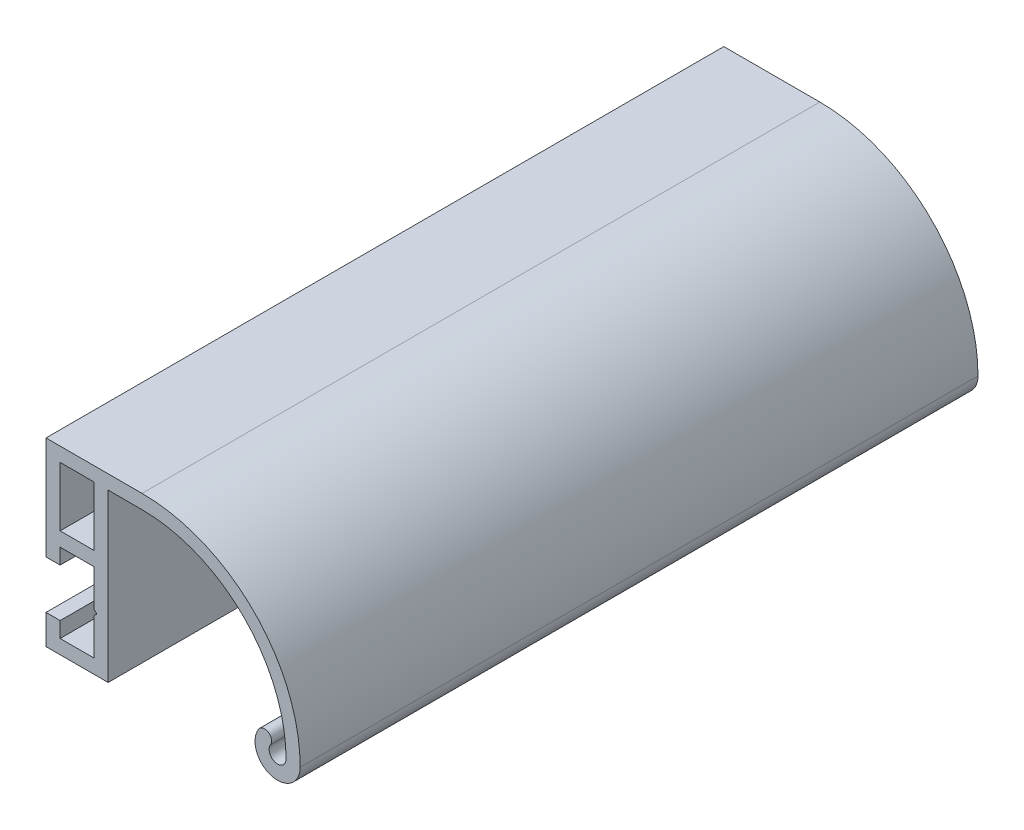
ISO-10303-21;
HEADER;
FILE_DESCRIPTION(('STEP AP214'),'2;1');
FILE_NAME('part.step','',(''),(''),'','','');
FILE_SCHEMA(('AUTOMOTIVE_DESIGN { 1 0 10303 214 1 1 1 1 }'));
ENDSEC;
DATA;
#1=APPLICATION_CONTEXT('core data for automotive mechanical design processes');
#2=APPLICATION_PROTOCOL_DEFINITION('international standard','automotive_design',2000,#1);
#3=PRODUCT_CONTEXT('',#1,'mechanical');
#4=PRODUCT('Part','Part','',(#3));
#5=PRODUCT_RELATED_PRODUCT_CATEGORY('part','',(#4));
#6=PRODUCT_DEFINITION_FORMATION('','',#4);
#7=PRODUCT_DEFINITION_CONTEXT('part definition',#1,'design');
#8=PRODUCT_DEFINITION('design','',#6,#7);
#9=PRODUCT_DEFINITION_SHAPE('','',#8);
#10=(LENGTH_UNIT() NAMED_UNIT(*) SI_UNIT(.MILLI.,.METRE.));
#11=(NAMED_UNIT(*) PLANE_ANGLE_UNIT() SI_UNIT($,.RADIAN.));
#12=(NAMED_UNIT(*) SI_UNIT($,.STERADIAN.) SOLID_ANGLE_UNIT());
#13=UNCERTAINTY_MEASURE_WITH_UNIT(LENGTH_MEASURE(1.E-05),#10,'distance_accuracy_value','');
#14=(GEOMETRIC_REPRESENTATION_CONTEXT(3) GLOBAL_UNCERTAINTY_ASSIGNED_CONTEXT((#13)) GLOBAL_UNIT_ASSIGNED_CONTEXT((#10,
#11,#12)) REPRESENTATION_CONTEXT('',''));
#15=CARTESIAN_POINT('',(0.,0.,0.));
#16=DIRECTION('',(0.,0.,1.));
#17=DIRECTION('',(1.,0.,0.));
#18=AXIS2_PLACEMENT_3D('',#15,#16,#17);
#19=CARTESIAN_POINT('',(-19.9999990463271,-4.2500000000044,-60.));
#20=DIRECTION('',(0.,1.,0.));
#21=DIRECTION('',(-1.,0.,0.));
#22=AXIS2_PLACEMENT_3D('',#19,#20,#21);
#23=PLANE('',#22);
#24=DIRECTION('',(0.,0.,1.));
#25=VECTOR('',#24,1.);
#26=CARTESIAN_POINT('',(-22.4999990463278,-4.25000000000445,-60.));
#27=LINE('',#26,#25);
#28=CARTESIAN_POINT('',(-22.4999990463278,-4.25000000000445,-60.));
#29=VERTEX_POINT('',#28);
#30=CARTESIAN_POINT('',(-22.4999990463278,-4.25000000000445,60.));
#31=VERTEX_POINT('',#30);
#32=EDGE_CURVE('E33',#29,#31,#27,.T.);
#33=ORIENTED_EDGE('',*,*,#32,.T.);
#34=DIRECTION('',(-1.,0.,0.));
#35=VECTOR('',#34,1.);
#36=CARTESIAN_POINT('',(-19.9999990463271,-4.2500000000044,60.));
#37=LINE('',#36,#35);
#38=CARTESIAN_POINT('',(-19.9999990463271,-4.2500000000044,60.));
#39=VERTEX_POINT('',#38);
#40=EDGE_CURVE('E227',#39,#31,#37,.T.);
#41=ORIENTED_EDGE('',*,*,#40,.F.);
#42=DIRECTION('',(0.,0.,1.));
#43=VECTOR('',#42,1.);
#44=CARTESIAN_POINT('',(-19.9999990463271,-4.2500000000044,-60.));
#45=LINE('',#44,#43);
#46=CARTESIAN_POINT('',(-19.9999990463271,-4.2500000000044,-60.));
#47=VERTEX_POINT('',#46);
#48=EDGE_CURVE('E11',#47,#39,#45,.T.);
#49=ORIENTED_EDGE('',*,*,#48,.F.);
#50=DIRECTION('',(-1.,0.,0.));
#51=VECTOR('',#50,1.);
#52=CARTESIAN_POINT('',(-19.9999990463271,-4.2500000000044,-60.));
#53=LINE('',#52,#51);
#54=EDGE_CURVE('E297',#47,#29,#53,.T.);
#55=ORIENTED_EDGE('',*,*,#54,.T.);
#56=EDGE_LOOP('',(#33,#41,#49,#55));
#57=FACE_BOUND('',#56,.T.);
#58=ADVANCED_FACE('F30',(#57),#23,.T.);
#59=CARTESIAN_POINT('',(-19.9999990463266,-7.0000000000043,-60.));
#60=DIRECTION('',(1.,1.58963751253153E-13,0.));
#61=DIRECTION('',(-1.58963751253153E-13,1.,0.));
#62=AXIS2_PLACEMENT_3D('',#59,#60,#61);
#63=PLANE('',#62);
#64=ORIENTED_EDGE('',*,*,#48,.T.);
#65=DIRECTION('',(-1.58963751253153E-13,1.,0.));
#66=VECTOR('',#65,1.);
#67=CARTESIAN_POINT('',(-19.9999990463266,-7.0000000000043,60.));
#68=LINE('',#67,#66);
#69=CARTESIAN_POINT('',(-19.9999990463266,-7.0000000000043,60.));
#70=VERTEX_POINT('',#69);
#71=EDGE_CURVE('E287',#70,#39,#68,.T.);
#72=ORIENTED_EDGE('',*,*,#71,.F.);
#73=DIRECTION('',(0.,0.,1.));
#74=VECTOR('',#73,1.);
#75=CARTESIAN_POINT('',(-19.9999990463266,-7.0000000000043,-60.));
#76=LINE('',#75,#74);
#77=CARTESIAN_POINT('',(-19.9999990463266,-7.0000000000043,-60.));
#78=VERTEX_POINT('',#77);
#79=EDGE_CURVE('E38',#78,#70,#76,.T.);
#80=ORIENTED_EDGE('',*,*,#79,.F.);
#81=DIRECTION('',(-1.58963751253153E-13,1.,0.));
#82=VECTOR('',#81,1.);
#83=CARTESIAN_POINT('',(-19.9999990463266,-7.0000000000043,-60.));
#84=LINE('',#83,#82);
#85=EDGE_CURVE('E359',#78,#47,#84,.T.);
#86=ORIENTED_EDGE('',*,*,#85,.T.);
#87=EDGE_LOOP('',(#64,#72,#80,#86));
#88=FACE_BOUND('',#87,.T.);
#89=ADVANCED_FACE('F406',(#88),#63,.T.);
#90=CARTESIAN_POINT('',(-13.9999990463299,-7.00000000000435,-60.));
#91=DIRECTION('',(0.,1.,0.));
#92=DIRECTION('',(-1.,0.,0.));
#93=AXIS2_PLACEMENT_3D('',#90,#91,#92);
#94=PLANE('',#93);
#95=ORIENTED_EDGE('',*,*,#79,.T.);
#96=DIRECTION('',(-1.,0.,0.));
#97=VECTOR('',#96,1.);
#98=CARTESIAN_POINT('',(-13.9999990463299,-7.00000000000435,60.));
#99=LINE('',#98,#97);
#100=CARTESIAN_POINT('',(-13.9999990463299,-7.00000000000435,60.));
#101=VERTEX_POINT('',#100);
#102=EDGE_CURVE('E284',#101,#70,#99,.T.);
#103=ORIENTED_EDGE('',*,*,#102,.F.);
#104=DIRECTION('',(0.,0.,1.));
#105=VECTOR('',#104,1.);
#106=CARTESIAN_POINT('',(-13.9999990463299,-7.00000000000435,-60.));
#107=LINE('',#106,#105);
#108=CARTESIAN_POINT('',(-13.9999990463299,-7.00000000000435,-60.));
#109=VERTEX_POINT('',#108);
#110=EDGE_CURVE('E363',#109,#101,#107,.T.);
#111=ORIENTED_EDGE('',*,*,#110,.F.);
#112=DIRECTION('',(-1.,0.,0.));
#113=VECTOR('',#112,1.);
#114=CARTESIAN_POINT('',(-13.9999990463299,-7.00000000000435,-60.));
#115=LINE('',#114,#113);
#116=EDGE_CURVE('E356',#109,#78,#115,.T.);
#117=ORIENTED_EDGE('',*,*,#116,.T.);
#118=EDGE_LOOP('',(#95,#103,#111,#117));
#119=FACE_BOUND('',#118,.T.);
#120=ADVANCED_FACE('F479',(#119),#94,.T.);
#121=CARTESIAN_POINT('',(-13.9999990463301,-0.500000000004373,-60.));
#122=DIRECTION('',(-1.,0.,0.));
#123=DIRECTION('',(0.,-1.,0.));
#124=AXIS2_PLACEMENT_3D('',#121,#122,#123);
#125=PLANE('',#124);
#126=ORIENTED_EDGE('',*,*,#110,.T.);
#127=DIRECTION('',(0.,-1.,0.));
#128=VECTOR('',#127,1.);
#129=CARTESIAN_POINT('',(-13.9999990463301,-0.500000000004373,60.));
#130=LINE('',#129,#128);
#131=CARTESIAN_POINT('',(-13.9999990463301,-0.500000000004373,60.));
#132=VERTEX_POINT('',#131);
#133=EDGE_CURVE('E281',#132,#101,#130,.T.);
#134=ORIENTED_EDGE('',*,*,#133,.F.);
#135=DIRECTION('',(0.,0.,1.));
#136=VECTOR('',#135,1.);
#137=CARTESIAN_POINT('',(-13.9999990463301,-0.500000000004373,-60.));
#138=LINE('',#137,#136);
#139=CARTESIAN_POINT('',(-13.9999990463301,-0.500000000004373,-60.));
#140=VERTEX_POINT('',#139);
#141=EDGE_CURVE('E365',#140,#132,#138,.T.);
#142=ORIENTED_EDGE('',*,*,#141,.F.);
#143=DIRECTION('',(0.,-1.,0.));
#144=VECTOR('',#143,1.);
#145=CARTESIAN_POINT('',(-13.9999990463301,-0.500000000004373,-60.));
#146=LINE('',#145,#144);
#147=EDGE_CURVE('E353',#140,#109,#146,.T.);
#148=ORIENTED_EDGE('',*,*,#147,.T.);
#149=EDGE_LOOP('',(#126,#134,#142,#148));
#150=FACE_BOUND('',#149,.T.);
#151=ADVANCED_FACE('F477',(#150),#125,.T.);
#152=CARTESIAN_POINT('',(-13.4999990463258,0.,-60.));
#153=DIRECTION('',(-0.70710678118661,0.707106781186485,0.));
#154=DIRECTION('',(-0.707106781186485,-0.70710678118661,0.));
#155=AXIS2_PLACEMENT_3D('',#152,#153,#154);
#156=PLANE('',#155);
#157=ORIENTED_EDGE('',*,*,#141,.T.);
#158=DIRECTION('',(-0.707106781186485,-0.70710678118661,0.));
#159=VECTOR('',#158,1.);
#160=CARTESIAN_POINT('',(-13.4999990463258,0.,60.));
#161=LINE('',#160,#159);
#162=CARTESIAN_POINT('',(-13.4999990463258,0.,60.));
#163=VERTEX_POINT('',#162);
#164=EDGE_CURVE('E278',#163,#132,#161,.T.);
#165=ORIENTED_EDGE('',*,*,#164,.F.);
#166=DIRECTION('',(0.,0.,1.));
#167=VECTOR('',#166,1.);
#168=CARTESIAN_POINT('',(-13.4999990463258,0.,-60.));
#169=LINE('',#168,#167);
#170=CARTESIAN_POINT('',(-13.4999990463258,0.,-60.));
#171=VERTEX_POINT('',#170);
#172=EDGE_CURVE('E367',#171,#163,#169,.T.);
#173=ORIENTED_EDGE('',*,*,#172,.F.);
#174=DIRECTION('',(-0.707106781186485,-0.70710678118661,0.));
#175=VECTOR('',#174,1.);
#176=CARTESIAN_POINT('',(-13.4999990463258,0.,-60.));
#177=LINE('',#176,#175);
#178=EDGE_CURVE('E350',#171,#140,#177,.T.);
#179=ORIENTED_EDGE('',*,*,#178,.T.);
#180=EDGE_LOOP('',(#157,#165,#173,#179));
#181=FACE_BOUND('',#180,.T.);
#182=ADVANCED_FACE('F473',(#181),#156,.T.);
#183=CARTESIAN_POINT('',(-13.9999990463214,0.499999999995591,-60.));
#184=DIRECTION('',(-0.707106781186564,-0.707106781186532,0.));
#185=DIRECTION('',(0.707106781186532,-0.707106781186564,0.));
#186=AXIS2_PLACEMENT_3D('',#183,#184,#185);
#187=PLANE('',#186);
#188=ORIENTED_EDGE('',*,*,#172,.T.);
#189=DIRECTION('',(0.707106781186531,-0.707106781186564,0.));
#190=VECTOR('',#189,1.);
#191=CARTESIAN_POINT('',(-13.9999990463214,0.499999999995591,60.));
#192=LINE('',#191,#190);
#193=CARTESIAN_POINT('',(-13.9999990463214,0.499999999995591,60.));
#194=VERTEX_POINT('',#193);
#195=EDGE_CURVE('E275',#194,#163,#192,.T.);
#196=ORIENTED_EDGE('',*,*,#195,.F.);
#197=DIRECTION('',(0.,0.,1.));
#198=VECTOR('',#197,1.);
#199=CARTESIAN_POINT('',(-13.9999990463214,0.499999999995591,-60.));
#200=LINE('',#199,#198);
#201=CARTESIAN_POINT('',(-13.9999990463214,0.499999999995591,-60.));
#202=VERTEX_POINT('',#201);
#203=EDGE_CURVE('E369',#202,#194,#200,.T.);
#204=ORIENTED_EDGE('',*,*,#203,.F.);
#205=DIRECTION('',(0.707106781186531,-0.707106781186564,0.));
#206=VECTOR('',#205,1.);
#207=CARTESIAN_POINT('',(-13.9999990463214,0.499999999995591,-60.));
#208=LINE('',#207,#206);
#209=EDGE_CURVE('E347',#202,#171,#208,.T.);
#210=ORIENTED_EDGE('',*,*,#209,.T.);
#211=EDGE_LOOP('',(#188,#196,#204,#210));
#212=FACE_BOUND('',#211,.T.);
#213=ADVANCED_FACE('F470',(#212),#187,.T.);
#214=CARTESIAN_POINT('',(-13.9999990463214,6.99999999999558,-60.));
#215=DIRECTION('',(-1.,0.,0.));
#216=DIRECTION('',(0.,-1.,0.));
#217=AXIS2_PLACEMENT_3D('',#214,#215,#216);
#218=PLANE('',#217);
#219=ORIENTED_EDGE('',*,*,#203,.T.);
#220=DIRECTION('',(0.,-1.,0.));
#221=VECTOR('',#220,1.);
#222=CARTESIAN_POINT('',(-13.9999990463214,6.99999999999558,60.));
#223=LINE('',#222,#221);
#224=CARTESIAN_POINT('',(-13.9999990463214,6.99999999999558,60.));
#225=VERTEX_POINT('',#224);
#226=EDGE_CURVE('E272',#225,#194,#223,.T.);
#227=ORIENTED_EDGE('',*,*,#226,.F.);
#228=DIRECTION('',(0.,0.,1.));
#229=VECTOR('',#228,1.);
#230=CARTESIAN_POINT('',(-13.9999990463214,6.99999999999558,-60.));
#231=LINE('',#230,#229);
#232=CARTESIAN_POINT('',(-13.9999990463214,6.99999999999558,-60.));
#233=VERTEX_POINT('',#232);
#234=EDGE_CURVE('E371',#233,#225,#231,.T.);
#235=ORIENTED_EDGE('',*,*,#234,.F.);
#236=DIRECTION('',(0.,-1.,0.));
#237=VECTOR('',#236,1.);
#238=CARTESIAN_POINT('',(-13.9999990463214,6.99999999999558,-60.));
#239=LINE('',#238,#237);
#240=EDGE_CURVE('E344',#233,#202,#239,.T.);
#241=ORIENTED_EDGE('',*,*,#240,.T.);
#242=EDGE_LOOP('',(#219,#227,#235,#241));
#243=FACE_BOUND('',#242,.T.);
#244=ADVANCED_FACE('F468',(#243),#218,.T.);
#245=CARTESIAN_POINT('',(-19.9999990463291,6.99999999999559,-60.));
#246=DIRECTION('',(0.,-1.,0.));
#247=DIRECTION('',(1.,0.,0.));
#248=AXIS2_PLACEMENT_3D('',#245,#246,#247);
#249=PLANE('',#248);
#250=ORIENTED_EDGE('',*,*,#234,.T.);
#251=DIRECTION('',(1.,0.,0.));
#252=VECTOR('',#251,1.);
#253=CARTESIAN_POINT('',(-19.9999990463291,6.99999999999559,60.));
#254=LINE('',#253,#252);
#255=CARTESIAN_POINT('',(-19.9999990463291,6.99999999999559,60.));
#256=VERTEX_POINT('',#255);
#257=EDGE_CURVE('E269',#256,#225,#254,.T.);
#258=ORIENTED_EDGE('',*,*,#257,.F.);
#259=DIRECTION('',(0.,0.,1.));
#260=VECTOR('',#259,1.);
#261=CARTESIAN_POINT('',(-19.9999990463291,6.99999999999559,-60.));
#262=LINE('',#261,#260);
#263=CARTESIAN_POINT('',(-19.9999990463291,6.99999999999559,-60.));
#264=VERTEX_POINT('',#263);
#265=EDGE_CURVE('E373',#264,#256,#262,.T.);
#266=ORIENTED_EDGE('',*,*,#265,.F.);
#267=DIRECTION('',(1.,0.,0.));
#268=VECTOR('',#267,1.);
#269=CARTESIAN_POINT('',(-19.9999990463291,6.99999999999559,-60.));
#270=LINE('',#269,#268);
#271=EDGE_CURVE('E341',#264,#233,#270,.T.);
#272=ORIENTED_EDGE('',*,*,#271,.T.);
#273=EDGE_LOOP('',(#250,#258,#266,#272));
#274=FACE_BOUND('',#273,.T.);
#275=ADVANCED_FACE('F463',(#274),#249,.T.);
#276=CARTESIAN_POINT('',(-19.9999990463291,4.24999999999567,-60.));
#277=DIRECTION('',(1.,0.,0.));
#278=DIRECTION('',(0.,1.,0.));
#279=AXIS2_PLACEMENT_3D('',#276,#277,#278);
#280=PLANE('',#279);
#281=ORIENTED_EDGE('',*,*,#265,.T.);
#282=DIRECTION('',(0.,1.,0.));
#283=VECTOR('',#282,1.);
#284=CARTESIAN_POINT('',(-19.9999990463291,4.24999999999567,60.));
#285=LINE('',#284,#283);
#286=CARTESIAN_POINT('',(-19.9999990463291,4.24999999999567,60.));
#287=VERTEX_POINT('',#286);
#288=EDGE_CURVE('E266',#287,#256,#285,.T.);
#289=ORIENTED_EDGE('',*,*,#288,.F.);
#290=DIRECTION('',(0.,0.,1.));
#291=VECTOR('',#290,1.);
#292=CARTESIAN_POINT('',(-19.9999990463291,4.24999999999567,-60.));
#293=LINE('',#292,#291);
#294=CARTESIAN_POINT('',(-19.9999990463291,4.24999999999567,-60.));
#295=VERTEX_POINT('',#294);
#296=EDGE_CURVE('E375',#295,#287,#293,.T.);
#297=ORIENTED_EDGE('',*,*,#296,.F.);
#298=DIRECTION('',(0.,1.,0.));
#299=VECTOR('',#298,1.);
#300=CARTESIAN_POINT('',(-19.9999990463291,4.24999999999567,-60.));
#301=LINE('',#300,#299);
#302=EDGE_CURVE('E338',#295,#264,#301,.T.);
#303=ORIENTED_EDGE('',*,*,#302,.T.);
#304=EDGE_LOOP('',(#281,#289,#297,#303));
#305=FACE_BOUND('',#304,.T.);
#306=ADVANCED_FACE('F458',(#305),#280,.T.);
#307=CARTESIAN_POINT('',(-22.4999990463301,4.2499999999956,-60.));
#308=DIRECTION('',(0.,-1.,0.));
#309=DIRECTION('',(1.,0.,0.));
#310=AXIS2_PLACEMENT_3D('',#307,#308,#309);
#311=PLANE('',#310);
#312=ORIENTED_EDGE('',*,*,#296,.T.);
#313=DIRECTION('',(1.,0.,0.));
#314=VECTOR('',#313,1.);
#315=CARTESIAN_POINT('',(-22.4999990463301,4.2499999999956,60.));
#316=LINE('',#315,#314);
#317=CARTESIAN_POINT('',(-22.4999990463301,4.2499999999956,60.));
#318=VERTEX_POINT('',#317);
#319=EDGE_CURVE('E263',#318,#287,#316,.T.);
#320=ORIENTED_EDGE('',*,*,#319,.F.);
#321=DIRECTION('',(0.,0.,1.));
#322=VECTOR('',#321,1.);
#323=CARTESIAN_POINT('',(-22.4999990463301,4.2499999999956,-60.));
#324=LINE('',#323,#322);
#325=CARTESIAN_POINT('',(-22.4999990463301,4.2499999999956,-60.));
#326=VERTEX_POINT('',#325);
#327=EDGE_CURVE('E377',#326,#318,#324,.T.);
#328=ORIENTED_EDGE('',*,*,#327,.F.);
#329=DIRECTION('',(1.,0.,0.));
#330=VECTOR('',#329,1.);
#331=CARTESIAN_POINT('',(-22.4999990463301,4.2499999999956,-60.));
#332=LINE('',#331,#330);
#333=EDGE_CURVE('E335',#326,#295,#332,.T.);
#334=ORIENTED_EDGE('',*,*,#333,.T.);
#335=EDGE_LOOP('',(#312,#320,#328,#334));
#336=FACE_BOUND('',#335,.T.);
#337=ADVANCED_FACE('F456',(#336),#311,.T.);
#338=CARTESIAN_POINT('',(-22.4999990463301,22.499998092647,-60.));
#339=DIRECTION('',(-1.,0.,0.));
#340=DIRECTION('',(0.,0.,1.));
#341=AXIS2_PLACEMENT_3D('',#338,#339,#340);
#342=PLANE('',#341);
#343=ORIENTED_EDGE('',*,*,#327,.T.);
#344=DIRECTION('',(0.,-1.,0.));
#345=VECTOR('',#344,1.);
#346=CARTESIAN_POINT('',(-22.4999990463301,22.499998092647,60.));
#347=LINE('',#346,#345);
#348=CARTESIAN_POINT('',(-22.4999990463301,22.499998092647,60.));
#349=VERTEX_POINT('',#348);
#350=EDGE_CURVE('E260',#349,#318,#347,.T.);
#351=ORIENTED_EDGE('',*,*,#350,.F.);
#352=DIRECTION('',(0.,0.,1.));
#353=VECTOR('',#352,1.);
#354=CARTESIAN_POINT('',(-22.4999990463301,22.499998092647,-60.));
#355=LINE('',#354,#353);
#356=CARTESIAN_POINT('',(-22.4999990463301,22.499998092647,-60.));
#357=VERTEX_POINT('',#356);
#358=EDGE_CURVE('E379',#357,#349,#355,.T.);
#359=ORIENTED_EDGE('',*,*,#358,.F.);
#360=DIRECTION('',(0.,-1.,0.));
#361=VECTOR('',#360,1.);
#362=CARTESIAN_POINT('',(-22.4999990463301,22.499998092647,-60.));
#363=LINE('',#362,#361);
#364=EDGE_CURVE('E332',#357,#326,#363,.T.);
#365=ORIENTED_EDGE('',*,*,#364,.T.);
#366=EDGE_LOOP('',(#343,#351,#359,#365));
#367=FACE_BOUND('',#366,.T.);
#368=ADVANCED_FACE('F451',(#367),#342,.T.);
#369=CARTESIAN_POINT('',(-5.4999990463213,22.499998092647,-60.));
#370=DIRECTION('',(0.,1.,0.));
#371=DIRECTION('',(-1.,0.,0.));
#372=AXIS2_PLACEMENT_3D('',#369,#370,#371);
#373=PLANE('',#372);
#374=ORIENTED_EDGE('',*,*,#358,.T.);
#375=DIRECTION('',(-1.,0.,0.));
#376=VECTOR('',#375,1.);
#377=CARTESIAN_POINT('',(-5.4999990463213,22.499998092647,60.));
#378=LINE('',#377,#376);
#379=CARTESIAN_POINT('',(-5.4999990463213,22.499998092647,60.));
#380=VERTEX_POINT('',#379);
#381=EDGE_CURVE('E257',#380,#349,#378,.T.);
#382=ORIENTED_EDGE('',*,*,#381,.F.);
#383=DIRECTION('',(0.,0.,1.));
#384=VECTOR('',#383,1.);
#385=CARTESIAN_POINT('',(-5.4999990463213,22.499998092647,-60.));
#386=LINE('',#385,#384);
#387=CARTESIAN_POINT('',(-5.4999990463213,22.499998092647,-60.));
#388=VERTEX_POINT('',#387);
#389=EDGE_CURVE('E381',#388,#380,#386,.T.);
#390=ORIENTED_EDGE('',*,*,#389,.F.);
#391=DIRECTION('',(-1.,0.,0.));
#392=VECTOR('',#391,1.);
#393=CARTESIAN_POINT('',(-5.4999990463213,22.499998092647,-60.));
#394=LINE('',#393,#392);
#395=EDGE_CURVE('E329',#388,#357,#394,.T.);
#396=ORIENTED_EDGE('',*,*,#395,.T.);
#397=EDGE_LOOP('',(#374,#382,#390,#396));
#398=FACE_BOUND('',#397,.T.);
#399=ADVANCED_FACE('F446',(#398),#373,.T.);
#400=CARTESIAN_POINT('',(-5.49999904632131,-5.50000000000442,-60.));
#401=DIRECTION('',(0.,0.,1.));
#402=DIRECTION('',(1.,0.,0.));
#403=AXIS2_PLACEMENT_3D('',#400,#401,#402);
#404=CYLINDRICAL_SURFACE('',#403,27.9999980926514);
#405=ORIENTED_EDGE('',*,*,#389,.T.);
#406=CARTESIAN_POINT('',(-5.49999904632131,-5.50000000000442,60.));
#407=DIRECTION('',(0.,0.,1.));
#408=DIRECTION('',(1.,0.,0.));
#409=AXIS2_PLACEMENT_3D('',#406,#407,#408);
#410=CIRCLE('',#409,27.9999980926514);
#411=CARTESIAN_POINT('',(22.4999990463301,-5.50000000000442,60.));
#412=VERTEX_POINT('',#411);
#413=EDGE_CURVE('E254',#412,#380,#410,.T.);
#414=ORIENTED_EDGE('',*,*,#413,.F.);
#415=DIRECTION('',(0.,0.,1.));
#416=VECTOR('',#415,1.);
#417=CARTESIAN_POINT('',(22.4999990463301,-5.50000000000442,-60.));
#418=LINE('',#417,#416);
#419=CARTESIAN_POINT('',(22.4999990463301,-5.50000000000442,-60.));
#420=VERTEX_POINT('',#419);
#421=EDGE_CURVE('E383',#420,#412,#418,.T.);
#422=ORIENTED_EDGE('',*,*,#421,.F.);
#423=CARTESIAN_POINT('',(-5.49999904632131,-5.50000000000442,-60.));
#424=DIRECTION('',(0.,0.,1.));
#425=DIRECTION('',(1.,0.,0.));
#426=AXIS2_PLACEMENT_3D('',#423,#424,#425);
#427=CIRCLE('',#426,27.9999980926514);
#428=EDGE_CURVE('E326',#420,#388,#427,.T.);
#429=ORIENTED_EDGE('',*,*,#428,.T.);
#430=EDGE_LOOP('',(#405,#414,#422,#429));
#431=FACE_BOUND('',#430,.T.);
#432=ADVANCED_FACE('F444',(#431),#404,.T.);
#433=CARTESIAN_POINT('',(18.4999983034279,-5.50000000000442,-60.));
#434=DIRECTION('',(0.,0.,1.));
#435=DIRECTION('',(1.,0.,0.));
#436=AXIS2_PLACEMENT_3D('',#433,#434,#435);
#437=CYLINDRICAL_SURFACE('',#436,4.00000074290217);
#438=ORIENTED_EDGE('',*,*,#421,.T.);
#439=CARTESIAN_POINT('',(18.4999983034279,-5.50000000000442,60.));
#440=DIRECTION('',(0.,0.,1.));
#441=DIRECTION('',(1.,0.,0.));
#442=AXIS2_PLACEMENT_3D('',#439,#440,#441);
#443=CIRCLE('',#442,4.00000074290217);
#444=CARTESIAN_POINT('',(15.1439566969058,-3.32353711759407,60.));
#445=VERTEX_POINT('',#444);
#446=EDGE_CURVE('E251',#445,#412,#443,.T.);
#447=ORIENTED_EDGE('',*,*,#446,.F.);
#448=DIRECTION('',(0.,0.,1.));
#449=VECTOR('',#448,1.);
#450=CARTESIAN_POINT('',(15.1439566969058,-3.32353711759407,-60.));
#451=LINE('',#450,#449);
#452=CARTESIAN_POINT('',(15.1439566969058,-3.32353711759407,-60.));
#453=VERTEX_POINT('',#452);
#454=EDGE_CURVE('E385',#453,#445,#451,.T.);
#455=ORIENTED_EDGE('',*,*,#454,.F.);
#456=CARTESIAN_POINT('',(18.4999983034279,-5.50000000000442,-60.));
#457=DIRECTION('',(0.,0.,1.));
#458=DIRECTION('',(1.,0.,0.));
#459=AXIS2_PLACEMENT_3D('',#456,#457,#458);
#460=CIRCLE('',#459,4.00000074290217);
#461=EDGE_CURVE('E323',#453,#420,#460,.T.);
#462=ORIENTED_EDGE('',*,*,#461,.T.);
#463=EDGE_LOOP('',(#438,#447,#455,#462));
#464=FACE_BOUND('',#463,.T.);
#465=ADVANCED_FACE('F439',(#464),#437,.T.);
#466=CARTESIAN_POINT('',(16.1927195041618,-4.00368164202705,-60.));
#467=DIRECTION('',(0.,0.,1.));
#468=DIRECTION('',(1.,0.,0.));
#469=AXIS2_PLACEMENT_3D('',#466,#467,#468);
#470=CYLINDRICAL_SURFACE('',#469,1.24999999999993);
#471=ORIENTED_EDGE('',*,*,#454,.T.);
#472=CARTESIAN_POINT('',(16.1927195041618,-4.00368164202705,60.));
#473=DIRECTION('',(0.,0.,1.));
#474=DIRECTION('',(1.,0.,0.));
#475=AXIS2_PLACEMENT_3D('',#472,#473,#474);
#476=CIRCLE('',#475,1.24999999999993);
#477=CARTESIAN_POINT('',(17.2414823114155,-4.68382616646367,60.));
#478=VERTEX_POINT('',#477);
#479=EDGE_CURVE('E248',#478,#445,#476,.T.);
#480=ORIENTED_EDGE('',*,*,#479,.F.);
#481=DIRECTION('',(0.,0.,1.));
#482=VECTOR('',#481,1.);
#483=CARTESIAN_POINT('',(17.2414823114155,-4.68382616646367,-60.));
#484=LINE('',#483,#482);
#485=CARTESIAN_POINT('',(17.2414823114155,-4.68382616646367,-60.));
#486=VERTEX_POINT('',#485);
#487=EDGE_CURVE('E387',#486,#478,#484,.T.);
#488=ORIENTED_EDGE('',*,*,#487,.F.);
#489=CARTESIAN_POINT('',(16.1927195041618,-4.00368164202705,-60.));
#490=DIRECTION('',(0.,0.,1.));
#491=DIRECTION('',(1.,0.,0.));
#492=AXIS2_PLACEMENT_3D('',#489,#490,#491);
#493=CIRCLE('',#492,1.24999999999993);
#494=EDGE_CURVE('E320',#486,#453,#493,.T.);
#495=ORIENTED_EDGE('',*,*,#494,.T.);
#496=EDGE_LOOP('',(#471,#480,#488,#495));
#497=FACE_BOUND('',#496,.T.);
#498=ADVANCED_FACE('F434',(#497),#470,.T.);
#499=CARTESIAN_POINT('',(18.4999983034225,-5.50000000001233,-60.));
#500=DIRECTION('',(0.,0.,1.));
#501=DIRECTION('',(1.,0.,0.));
#502=AXIS2_PLACEMENT_3D('',#499,#500,#501);
#503=CYLINDRICAL_SURFACE('',#502,1.50000074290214);
#504=ORIENTED_EDGE('',*,*,#487,.T.);
#505=CARTESIAN_POINT('',(18.4999983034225,-5.50000000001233,60.));
#506=DIRECTION('',(0.,0.,-1.));
#507=DIRECTION('',(1.,0.,0.));
#508=AXIS2_PLACEMENT_3D('',#505,#506,#507);
#509=CIRCLE('',#508,1.50000074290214);
#510=CARTESIAN_POINT('',(19.9999990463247,-5.49999998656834,60.));
#511=VERTEX_POINT('',#510);
#512=EDGE_CURVE('E245',#511,#478,#509,.T.);
#513=ORIENTED_EDGE('',*,*,#512,.F.);
#514=DIRECTION('',(0.,0.,1.));
#515=VECTOR('',#514,1.);
#516=CARTESIAN_POINT('',(19.9999990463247,-5.49999998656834,-60.));
#517=LINE('',#516,#515);
#518=CARTESIAN_POINT('',(19.9999990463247,-5.49999998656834,-60.));
#519=VERTEX_POINT('',#518);
#520=EDGE_CURVE('E389',#519,#511,#517,.T.);
#521=ORIENTED_EDGE('',*,*,#520,.F.);
#522=CARTESIAN_POINT('',(18.4999983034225,-5.50000000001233,-60.));
#523=DIRECTION('',(0.,0.,-1.));
#524=DIRECTION('',(1.,0.,0.));
#525=AXIS2_PLACEMENT_3D('',#522,#523,#524);
#526=CIRCLE('',#525,1.50000074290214);
#527=EDGE_CURVE('E317',#519,#486,#526,.T.);
#528=ORIENTED_EDGE('',*,*,#527,.T.);
#529=EDGE_LOOP('',(#504,#513,#521,#528));
#530=FACE_BOUND('',#529,.T.);
#531=ADVANCED_FACE('F432',(#530),#503,.F.);
#532=CARTESIAN_POINT('',(-5.49999904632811,-5.50000043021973,-60.));
#533=DIRECTION('',(0.,0.,1.));
#534=DIRECTION('',(1.,0.,0.));
#535=AXIS2_PLACEMENT_3D('',#532,#533,#534);
#536=CYLINDRICAL_SURFACE('',#535,25.4999980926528);
#537=ORIENTED_EDGE('',*,*,#520,.T.);
#538=CARTESIAN_POINT('',(-5.49999904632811,-5.50000043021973,60.));
#539=DIRECTION('',(0.,0.,-1.));
#540=DIRECTION('',(1.,0.,0.));
#541=AXIS2_PLACEMENT_3D('',#538,#539,#540);
#542=CIRCLE('',#541,25.4999980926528);
#543=CARTESIAN_POINT('',(-5.49999904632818,19.9999976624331,60.));
#544=VERTEX_POINT('',#543);
#545=EDGE_CURVE('E242',#544,#511,#542,.T.);
#546=ORIENTED_EDGE('',*,*,#545,.F.);
#547=DIRECTION('',(0.,0.,1.));
#548=VECTOR('',#547,1.);
#549=CARTESIAN_POINT('',(-5.49999904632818,19.9999976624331,-60.));
#550=LINE('',#549,#548);
#551=CARTESIAN_POINT('',(-5.49999904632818,19.9999976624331,-60.));
#552=VERTEX_POINT('',#551);
#553=EDGE_CURVE('E391',#552,#544,#550,.T.);
#554=ORIENTED_EDGE('',*,*,#553,.F.);
#555=CARTESIAN_POINT('',(-5.49999904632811,-5.50000043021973,-60.));
#556=DIRECTION('',(0.,0.,-1.));
#557=DIRECTION('',(1.,0.,0.));
#558=AXIS2_PLACEMENT_3D('',#555,#556,#557);
#559=CIRCLE('',#558,25.4999980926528);
#560=EDGE_CURVE('E314',#552,#519,#559,.T.);
#561=ORIENTED_EDGE('',*,*,#560,.T.);
#562=EDGE_LOOP('',(#537,#546,#554,#561));
#563=FACE_BOUND('',#562,.T.);
#564=ADVANCED_FACE('F427',(#563),#536,.F.);
#565=CARTESIAN_POINT('',(-11.4999990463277,19.9999976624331,-60.));
#566=DIRECTION('',(0.,-1.,0.));
#567=DIRECTION('',(0.,0.,-1.));
#568=AXIS2_PLACEMENT_3D('',#565,#566,#567);
#569=PLANE('',#568);
#570=ORIENTED_EDGE('',*,*,#553,.T.);
#571=DIRECTION('',(1.,0.,0.));
#572=VECTOR('',#571,1.);
#573=CARTESIAN_POINT('',(-11.4999990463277,19.9999976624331,60.));
#574=LINE('',#573,#572);
#575=CARTESIAN_POINT('',(-11.4999990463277,19.9999976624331,60.));
#576=VERTEX_POINT('',#575);
#577=EDGE_CURVE('E239',#576,#544,#574,.T.);
#578=ORIENTED_EDGE('',*,*,#577,.F.);
#579=DIRECTION('',(0.,0.,1.));
#580=VECTOR('',#579,1.);
#581=CARTESIAN_POINT('',(-11.4999990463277,19.9999976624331,-60.));
#582=LINE('',#581,#580);
#583=CARTESIAN_POINT('',(-11.4999990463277,19.9999976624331,-60.));
#584=VERTEX_POINT('',#583);
#585=EDGE_CURVE('E393',#584,#576,#582,.T.);
#586=ORIENTED_EDGE('',*,*,#585,.F.);
#587=DIRECTION('',(1.,0.,0.));
#588=VECTOR('',#587,1.);
#589=CARTESIAN_POINT('',(-11.4999990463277,19.9999976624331,-60.));
#590=LINE('',#589,#588);
#591=EDGE_CURVE('E311',#584,#552,#590,.T.);
#592=ORIENTED_EDGE('',*,*,#591,.T.);
#593=EDGE_LOOP('',(#570,#578,#586,#592));
#594=FACE_BOUND('',#593,.T.);
#595=ADVANCED_FACE('F422',(#594),#569,.T.);
#596=CARTESIAN_POINT('',(-11.4999990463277,-9.50000000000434,-60.));
#597=DIRECTION('',(1.,0.,0.));
#598=DIRECTION('',(0.,0.,-1.));
#599=AXIS2_PLACEMENT_3D('',#596,#597,#598);
#600=PLANE('',#599);
#601=ORIENTED_EDGE('',*,*,#585,.T.);
#602=DIRECTION('',(0.,1.,0.));
#603=VECTOR('',#602,1.);
#604=CARTESIAN_POINT('',(-11.4999990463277,-9.50000000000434,60.));
#605=LINE('',#604,#603);
#606=CARTESIAN_POINT('',(-11.4999990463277,-9.50000000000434,60.));
#607=VERTEX_POINT('',#606);
#608=EDGE_CURVE('E236',#607,#576,#605,.T.);
#609=ORIENTED_EDGE('',*,*,#608,.F.);
#610=DIRECTION('',(0.,0.,1.));
#611=VECTOR('',#610,1.);
#612=CARTESIAN_POINT('',(-11.4999990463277,-9.50000000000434,-60.));
#613=LINE('',#612,#611);
#614=CARTESIAN_POINT('',(-11.4999990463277,-9.50000000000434,-60.));
#615=VERTEX_POINT('',#614);
#616=EDGE_CURVE('E395',#615,#607,#613,.T.);
#617=ORIENTED_EDGE('',*,*,#616,.F.);
#618=DIRECTION('',(0.,1.,0.));
#619=VECTOR('',#618,1.);
#620=CARTESIAN_POINT('',(-11.4999990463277,-9.50000000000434,-60.));
#621=LINE('',#620,#619);
#622=EDGE_CURVE('E308',#615,#584,#621,.T.);
#623=ORIENTED_EDGE('',*,*,#622,.T.);
#624=EDGE_LOOP('',(#601,#609,#617,#623));
#625=FACE_BOUND('',#624,.T.);
#626=ADVANCED_FACE('F420',(#625),#600,.T.);
#627=CARTESIAN_POINT('',(-22.4999990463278,-9.50000000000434,-60.));
#628=DIRECTION('',(0.,-1.,0.));
#629=DIRECTION('',(0.,0.,-1.));
#630=AXIS2_PLACEMENT_3D('',#627,#628,#629);
#631=PLANE('',#630);
#632=ORIENTED_EDGE('',*,*,#616,.T.);
#633=DIRECTION('',(1.,0.,0.));
#634=VECTOR('',#633,1.);
#635=CARTESIAN_POINT('',(-22.4999990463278,-9.50000000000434,60.));
#636=LINE('',#635,#634);
#637=CARTESIAN_POINT('',(-22.4999990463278,-9.50000000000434,60.));
#638=VERTEX_POINT('',#637);
#639=EDGE_CURVE('E233',#638,#607,#636,.T.);
#640=ORIENTED_EDGE('',*,*,#639,.F.);
#641=DIRECTION('',(0.,0.,1.));
#642=VECTOR('',#641,1.);
#643=CARTESIAN_POINT('',(-22.4999990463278,-9.50000000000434,-60.));
#644=LINE('',#643,#642);
#645=CARTESIAN_POINT('',(-22.4999990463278,-9.50000000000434,-60.));
#646=VERTEX_POINT('',#645);
#647=EDGE_CURVE('E396',#646,#638,#644,.T.);
#648=ORIENTED_EDGE('',*,*,#647,.F.);
#649=DIRECTION('',(1.,0.,0.));
#650=VECTOR('',#649,1.);
#651=CARTESIAN_POINT('',(-22.4999990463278,-9.50000000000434,-60.));
#652=LINE('',#651,#650);
#653=EDGE_CURVE('E305',#646,#615,#652,.T.);
#654=ORIENTED_EDGE('',*,*,#653,.T.);
#655=EDGE_LOOP('',(#632,#640,#648,#654));
#656=FACE_BOUND('',#655,.T.);
#657=ADVANCED_FACE('F416',(#656),#631,.T.);
#658=CARTESIAN_POINT('',(-22.4999990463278,-4.25000000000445,-60.));
#659=DIRECTION('',(-1.,0.,0.));
#660=DIRECTION('',(0.,-1.,0.));
#661=AXIS2_PLACEMENT_3D('',#658,#659,#660);
#662=PLANE('',#661);
#663=ORIENTED_EDGE('',*,*,#647,.T.);
#664=DIRECTION('',(0.,-1.,0.));
#665=VECTOR('',#664,1.);
#666=CARTESIAN_POINT('',(-22.4999990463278,-4.25000000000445,60.));
#667=LINE('',#666,#665);
#668=EDGE_CURVE('E230',#31,#638,#667,.T.);
#669=ORIENTED_EDGE('',*,*,#668,.F.);
#670=ORIENTED_EDGE('',*,*,#32,.F.);
#671=DIRECTION('',(0.,-1.,0.));
#672=VECTOR('',#671,1.);
#673=CARTESIAN_POINT('',(-22.4999990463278,-4.25000000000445,-60.));
#674=LINE('',#673,#672);
#675=EDGE_CURVE('E302',#29,#646,#674,.T.);
#676=ORIENTED_EDGE('',*,*,#675,.T.);
#677=EDGE_LOOP('',(#663,#669,#670,#676));
#678=FACE_BOUND('',#677,.T.);
#679=ADVANCED_FACE('F400',(#678),#662,.T.);
#680=CARTESIAN_POINT('',(-5.49999904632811,-5.50000043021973,-60.));
#681=DIRECTION('',(0.,0.,1.));
#682=DIRECTION('',(1.,0.,0.));
#683=AXIS2_PLACEMENT_3D('',#680,#681,#682);
#684=PLANE('',#683);
#685=DIRECTION('',(1.,0.,0.));
#686=VECTOR('',#685,1.);
#687=CARTESIAN_POINT('',(-13.9999990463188,9.49999999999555,-60.));
#688=LINE('',#687,#686);
#689=CARTESIAN_POINT('',(-19.9999990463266,9.49999999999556,-60.));
#690=VERTEX_POINT('',#689);
#691=CARTESIAN_POINT('',(-13.9999990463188,9.49999999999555,-60.));
#692=VERTEX_POINT('',#691);
#693=EDGE_CURVE('E209',#690,#692,#688,.T.);
#694=ORIENTED_EDGE('',*,*,#693,.T.);
#695=DIRECTION('',(0.,1.,0.));
#696=VECTOR('',#695,1.);
#697=CARTESIAN_POINT('',(-13.9999990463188,19.999998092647,-60.));
#698=LINE('',#697,#696);
#699=CARTESIAN_POINT('',(-13.9999990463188,19.999998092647,-60.));
#700=VERTEX_POINT('',#699);
#701=EDGE_CURVE('E290',#692,#700,#698,.T.);
#702=ORIENTED_EDGE('',*,*,#701,.T.);
#703=DIRECTION('',(-1.,0.,0.));
#704=VECTOR('',#703,1.);
#705=CARTESIAN_POINT('',(-19.9999990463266,19.999998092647,-60.));
#706=LINE('',#705,#704);
#707=CARTESIAN_POINT('',(-19.9999990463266,19.999998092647,-60.));
#708=VERTEX_POINT('',#707);
#709=EDGE_CURVE('E204',#700,#708,#706,.T.);
#710=ORIENTED_EDGE('',*,*,#709,.T.);
#711=DIRECTION('',(0.,-1.,0.));
#712=VECTOR('',#711,1.);
#713=CARTESIAN_POINT('',(-19.9999990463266,9.49999999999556,-60.));
#714=LINE('',#713,#712);
#715=EDGE_CURVE('E46',#708,#690,#714,.T.);
#716=ORIENTED_EDGE('',*,*,#715,.T.);
#717=EDGE_LOOP('',(#694,#702,#710,#716));
#718=FACE_BOUND('',#717,.T.);
#719=ORIENTED_EDGE('',*,*,#54,.F.);
#720=ORIENTED_EDGE('',*,*,#85,.F.);
#721=ORIENTED_EDGE('',*,*,#116,.F.);
#722=ORIENTED_EDGE('',*,*,#147,.F.);
#723=ORIENTED_EDGE('',*,*,#178,.F.);
#724=ORIENTED_EDGE('',*,*,#209,.F.);
#725=ORIENTED_EDGE('',*,*,#240,.F.);
#726=ORIENTED_EDGE('',*,*,#271,.F.);
#727=ORIENTED_EDGE('',*,*,#302,.F.);
#728=ORIENTED_EDGE('',*,*,#333,.F.);
#729=ORIENTED_EDGE('',*,*,#364,.F.);
#730=ORIENTED_EDGE('',*,*,#395,.F.);
#731=ORIENTED_EDGE('',*,*,#428,.F.);
#732=ORIENTED_EDGE('',*,*,#461,.F.);
#733=ORIENTED_EDGE('',*,*,#494,.F.);
#734=ORIENTED_EDGE('',*,*,#527,.F.);
#735=ORIENTED_EDGE('',*,*,#560,.F.);
#736=ORIENTED_EDGE('',*,*,#591,.F.);
#737=ORIENTED_EDGE('',*,*,#622,.F.);
#738=ORIENTED_EDGE('',*,*,#653,.F.);
#739=ORIENTED_EDGE('',*,*,#675,.F.);
#740=EDGE_LOOP('',(#719,#720,#721,#722,#723,#724,#725,#726,#727,#728,#729,#730,#731,#732,#733,
#734,#735,#736,#737,#738,#739));
#741=FACE_BOUND('',#740,.T.);
#742=ADVANCED_FACE('F410',(#718,#741),#684,.F.);
#743=CARTESIAN_POINT('',(-13.9999990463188,19.999998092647,-60.));
#744=DIRECTION('',(1.,0.,0.));
#745=DIRECTION('',(0.,0.,-1.));
#746=AXIS2_PLACEMENT_3D('',#743,#744,#745);
#747=PLANE('',#746);
#748=DIRECTION('',(0.,0.,1.));
#749=VECTOR('',#748,1.);
#750=CARTESIAN_POINT('',(-13.9999990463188,9.49999999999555,-60.));
#751=LINE('',#750,#749);
#752=CARTESIAN_POINT('',(-13.9999990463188,9.49999999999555,60.));
#753=VERTEX_POINT('',#752);
#754=EDGE_CURVE('E214',#692,#753,#751,.T.);
#755=ORIENTED_EDGE('',*,*,#754,.T.);
#756=DIRECTION('',(0.,1.,0.));
#757=VECTOR('',#756,1.);
#758=CARTESIAN_POINT('',(-13.9999990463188,19.999998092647,60.));
#759=LINE('',#758,#757);
#760=CARTESIAN_POINT('',(-13.9999990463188,19.999998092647,60.));
#761=VERTEX_POINT('',#760);
#762=EDGE_CURVE('E212',#753,#761,#759,.T.);
#763=ORIENTED_EDGE('',*,*,#762,.T.);
#764=DIRECTION('',(0.,0.,1.));
#765=VECTOR('',#764,1.);
#766=CARTESIAN_POINT('',(-13.9999990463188,19.999998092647,-60.));
#767=LINE('',#766,#765);
#768=EDGE_CURVE('E197',#700,#761,#767,.T.);
#769=ORIENTED_EDGE('',*,*,#768,.F.);
#770=ORIENTED_EDGE('',*,*,#701,.F.);
#771=EDGE_LOOP('',(#755,#763,#769,#770));
#772=FACE_BOUND('',#771,.T.);
#773=ADVANCED_FACE('F213',(#772),#747,.F.);
#774=CARTESIAN_POINT('',(-13.9999990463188,9.49999999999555,-60.));
#775=DIRECTION('',(0.,-1.,0.));
#776=DIRECTION('',(1.,0.,0.));
#777=AXIS2_PLACEMENT_3D('',#774,#775,#776);
#778=PLANE('',#777);
#779=DIRECTION('',(0.,0.,1.));
#780=VECTOR('',#779,1.);
#781=CARTESIAN_POINT('',(-19.9999990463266,9.49999999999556,-60.));
#782=LINE('',#781,#780);
#783=CARTESIAN_POINT('',(-19.9999990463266,9.49999999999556,60.));
#784=VERTEX_POINT('',#783);
#785=EDGE_CURVE('E298',#690,#784,#782,.T.);
#786=ORIENTED_EDGE('',*,*,#785,.T.);
#787=DIRECTION('',(1.,0.,0.));
#788=VECTOR('',#787,1.);
#789=CARTESIAN_POINT('',(-13.9999990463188,9.49999999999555,60.));
#790=LINE('',#789,#788);
#791=EDGE_CURVE('E223',#784,#753,#790,.T.);
#792=ORIENTED_EDGE('',*,*,#791,.T.);
#793=ORIENTED_EDGE('',*,*,#754,.F.);
#794=ORIENTED_EDGE('',*,*,#693,.F.);
#795=EDGE_LOOP('',(#786,#792,#793,#794));
#796=FACE_BOUND('',#795,.T.);
#797=ADVANCED_FACE('F658',(#796),#778,.F.);
#798=CARTESIAN_POINT('',(-19.9999990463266,9.49999999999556,-60.));
#799=DIRECTION('',(-1.,0.,0.));
#800=DIRECTION('',(0.,-1.,0.));
#801=AXIS2_PLACEMENT_3D('',#798,#799,#800);
#802=PLANE('',#801);
#803=DIRECTION('',(0.,0.,1.));
#804=VECTOR('',#803,1.);
#805=CARTESIAN_POINT('',(-19.9999990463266,19.999998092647,-60.));
#806=LINE('',#805,#804);
#807=CARTESIAN_POINT('',(-19.9999990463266,19.999998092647,60.));
#808=VERTEX_POINT('',#807);
#809=EDGE_CURVE('E208',#708,#808,#806,.T.);
#810=ORIENTED_EDGE('',*,*,#809,.T.);
#811=DIRECTION('',(0.,-1.,0.));
#812=VECTOR('',#811,1.);
#813=CARTESIAN_POINT('',(-19.9999990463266,9.49999999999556,60.));
#814=LINE('',#813,#812);
#815=EDGE_CURVE('E221',#808,#784,#814,.T.);
#816=ORIENTED_EDGE('',*,*,#815,.T.);
#817=ORIENTED_EDGE('',*,*,#785,.F.);
#818=ORIENTED_EDGE('',*,*,#715,.F.);
#819=EDGE_LOOP('',(#810,#816,#817,#818));
#820=FACE_BOUND('',#819,.T.);
#821=ADVANCED_FACE('F667',(#820),#802,.F.);
#822=CARTESIAN_POINT('',(-19.9999990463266,19.999998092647,-60.));
#823=DIRECTION('',(0.,1.,0.));
#824=DIRECTION('',(0.,0.,1.));
#825=AXIS2_PLACEMENT_3D('',#822,#823,#824);
#826=PLANE('',#825);
#827=ORIENTED_EDGE('',*,*,#768,.T.);
#828=DIRECTION('',(-1.,0.,0.));
#829=VECTOR('',#828,1.);
#830=CARTESIAN_POINT('',(-19.9999990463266,19.999998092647,60.));
#831=LINE('',#830,#829);
#832=EDGE_CURVE('E201',#761,#808,#831,.T.);
#833=ORIENTED_EDGE('',*,*,#832,.T.);
#834=ORIENTED_EDGE('',*,*,#809,.F.);
#835=ORIENTED_EDGE('',*,*,#709,.F.);
#836=EDGE_LOOP('',(#827,#833,#834,#835));
#837=FACE_BOUND('',#836,.T.);
#838=ADVANCED_FACE('F199',(#837),#826,.F.);
#839=CARTESIAN_POINT('',(-5.49999904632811,-5.50000043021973,60.));
#840=DIRECTION('',(0.,0.,1.));
#841=DIRECTION('',(1.,0.,0.));
#842=AXIS2_PLACEMENT_3D('',#839,#840,#841);
#843=PLANE('',#842);
#844=ORIENTED_EDGE('',*,*,#40,.T.);
#845=ORIENTED_EDGE('',*,*,#668,.T.);
#846=ORIENTED_EDGE('',*,*,#639,.T.);
#847=ORIENTED_EDGE('',*,*,#608,.T.);
#848=ORIENTED_EDGE('',*,*,#577,.T.);
#849=ORIENTED_EDGE('',*,*,#545,.T.);
#850=ORIENTED_EDGE('',*,*,#512,.T.);
#851=ORIENTED_EDGE('',*,*,#479,.T.);
#852=ORIENTED_EDGE('',*,*,#446,.T.);
#853=ORIENTED_EDGE('',*,*,#413,.T.);
#854=ORIENTED_EDGE('',*,*,#381,.T.);
#855=ORIENTED_EDGE('',*,*,#350,.T.);
#856=ORIENTED_EDGE('',*,*,#319,.T.);
#857=ORIENTED_EDGE('',*,*,#288,.T.);
#858=ORIENTED_EDGE('',*,*,#257,.T.);
#859=ORIENTED_EDGE('',*,*,#226,.T.);
#860=ORIENTED_EDGE('',*,*,#195,.T.);
#861=ORIENTED_EDGE('',*,*,#164,.T.);
#862=ORIENTED_EDGE('',*,*,#133,.T.);
#863=ORIENTED_EDGE('',*,*,#102,.T.);
#864=ORIENTED_EDGE('',*,*,#71,.T.);
#865=EDGE_LOOP('',(#844,#845,#846,#847,#848,#849,#850,#851,#852,#853,#854,#855,#856,#857,#858,
#859,#860,#861,#862,#863,#864));
#866=FACE_BOUND('',#865,.T.);
#867=ORIENTED_EDGE('',*,*,#832,.F.);
#868=ORIENTED_EDGE('',*,*,#762,.F.);
#869=ORIENTED_EDGE('',*,*,#791,.F.);
#870=ORIENTED_EDGE('',*,*,#815,.F.);
#871=EDGE_LOOP('',(#867,#868,#869,#870));
#872=FACE_BOUND('',#871,.T.);
#873=ADVANCED_FACE('F219',(#866,#872),#843,.T.);
#874=CLOSED_SHELL('',(#58,#89,#120,#151,#182,#213,#244,#275,#306,#337,#368,#399,#432,#465,#498,
#531,#564,#595,#626,#657,#679,#742,#773,#797,#821,#838,#873));
#875=MANIFOLD_SOLID_BREP('B2',#874);
#876=ADVANCED_BREP_SHAPE_REPRESENTATION('',(#18,#875),#14);
#877=SHAPE_DEFINITION_REPRESENTATION(#9,#876);
ENDSEC;
END-ISO-10303-21;
